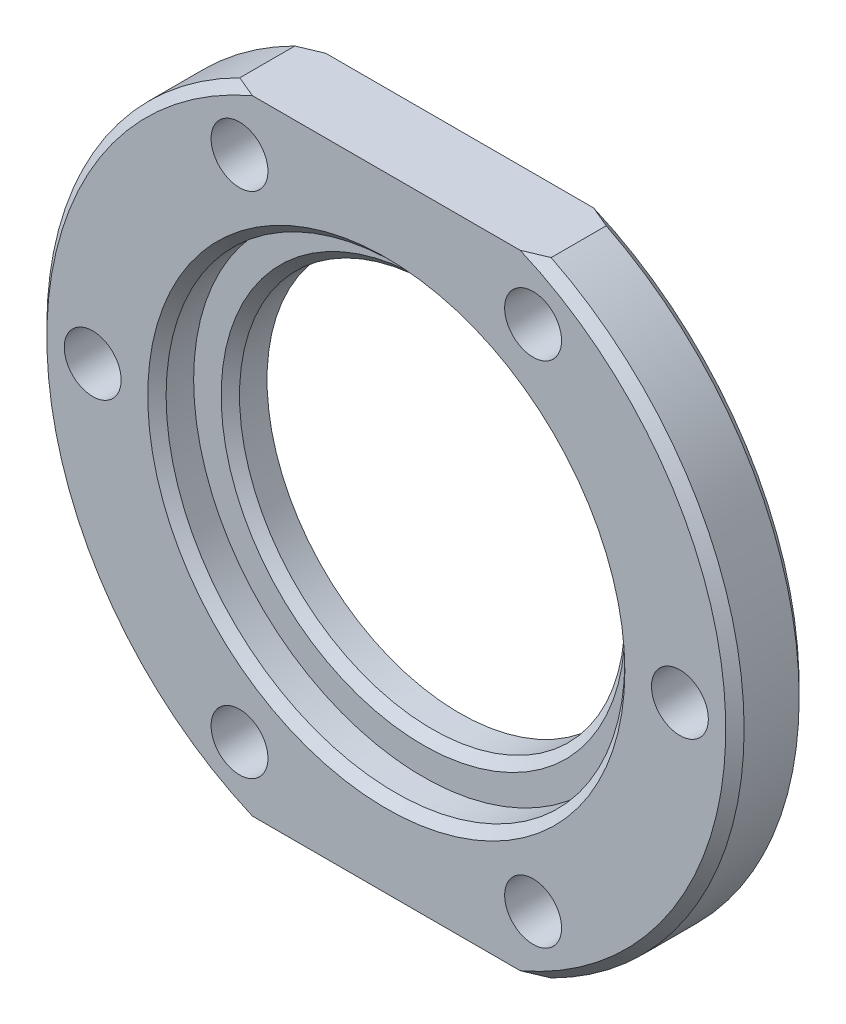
from build123d import *

# Parameters (mm, degrees)
BOSS_EXTRUDE1_DEPTH = 4
SKETCH2_R           = 12.5
CUT_EXTRUDE1_DEPTH  = 2
SKETCH3_R           = 10.5
CUT_EXTRUDE2_DEPTH  = 12
SKETCH4_R           = 1.55
CUT_EXTRUDE3_DEPTH  = 12
CHAMFER1_SIZE       = 0.5


with BuildPart() as part:
    # Sketch1 → Boss-Extrude1 (new body)
    with BuildSketch(Plane.XY):
        with BuildLine():
            Line((-8.485, 17), (8.485, 17))
            ThreePointArc((8.485, 17), (18.999874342, 0), (8.485, -17))
            Line((8.485, -17), (-8.485, -17))
            ThreePointArc((-8.485, -17), (-18.999874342, 0), (-8.485, 17))
        make_face()
    extrude(amount=BOSS_EXTRUDE1_DEPTH)

    # Sketch2 → Cut-Extrude1 (cut)
    with BuildSketch(Plane.XY.offset(4)):
        Circle(SKETCH2_R)
    extrude(amount=-CUT_EXTRUDE1_DEPTH, mode=Mode.SUBTRACT)

    # Sketch3 → Cut-Extrude2 (cut)
    with BuildSketch(Plane.XY.offset(2)):
        Circle(SKETCH3_R)
    extrude(amount=-CUT_EXTRUDE2_DEPTH, mode=Mode.SUBTRACT)

    # Sketch4 → Cut-Extrude3 (cut)
    with BuildSketch(Plane.XY.offset(4)):
        with Locations((-16, 0)):
            Circle(SKETCH4_R)
        with Locations((-8, 13.856406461)):
            Circle(SKETCH4_R)
        with Locations((8, 13.856406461)):
            Circle(SKETCH4_R)
        with Locations((16, 0)):
            Circle(SKETCH4_R)
        with Locations((8, -13.856406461)):
            Circle(SKETCH4_R)
        with Locations((-8, -13.856406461)):
            Circle(SKETCH4_R)
    extrude(amount=-CUT_EXTRUDE3_DEPTH, mode=Mode.SUBTRACT)

    # Chamfer1
    chamfer1_edges = [part.edges().sort_by_distance(p)[0] for p in [
        (18.999874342, 0, 4),
        (-12.5, 0, 4),
        (-10.5, 0, 2),
        (-18.999874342, 0, 4),
        (18.999874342, 0, 0),
        (-18.999874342, 0, 0),
    ]]
    chamfer(chamfer1_edges, length=CHAMFER1_SIZE)


solid = part.part
